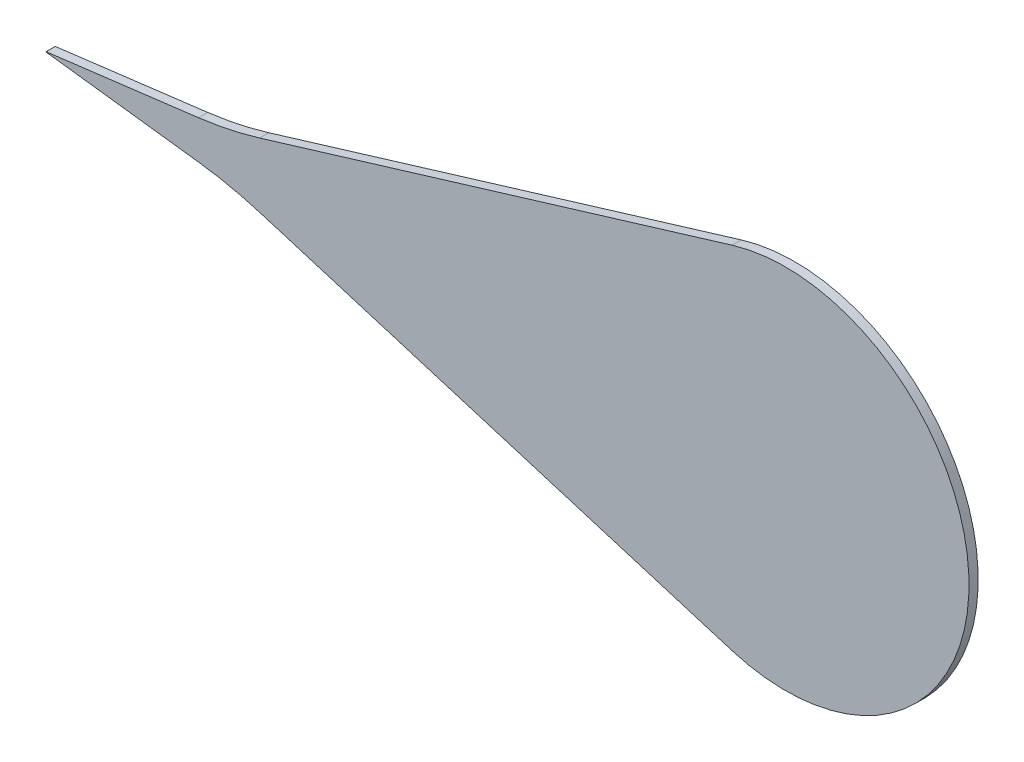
ISO-10303-21;
HEADER;
FILE_DESCRIPTION(('STEP AP214'),'2;1');
FILE_NAME('part.step','',(''),(''),'','','');
FILE_SCHEMA(('AUTOMOTIVE_DESIGN { 1 0 10303 214 1 1 1 1 }'));
ENDSEC;
DATA;
#1=APPLICATION_CONTEXT('core data for automotive mechanical design processes');
#2=APPLICATION_PROTOCOL_DEFINITION('international standard','automotive_design',2000,#1);
#3=PRODUCT_CONTEXT('',#1,'mechanical');
#4=PRODUCT('Part','Part','',(#3));
#5=PRODUCT_RELATED_PRODUCT_CATEGORY('part','',(#4));
#6=PRODUCT_DEFINITION_FORMATION('','',#4);
#7=PRODUCT_DEFINITION_CONTEXT('part definition',#1,'design');
#8=PRODUCT_DEFINITION('design','',#6,#7);
#9=PRODUCT_DEFINITION_SHAPE('','',#8);
#10=(LENGTH_UNIT() NAMED_UNIT(*) SI_UNIT(.MILLI.,.METRE.));
#11=(NAMED_UNIT(*) PLANE_ANGLE_UNIT() SI_UNIT($,.RADIAN.));
#12=(NAMED_UNIT(*) SI_UNIT($,.STERADIAN.) SOLID_ANGLE_UNIT());
#13=UNCERTAINTY_MEASURE_WITH_UNIT(LENGTH_MEASURE(1.E-05),#10,'distance_accuracy_value','');
#14=(GEOMETRIC_REPRESENTATION_CONTEXT(3) GLOBAL_UNCERTAINTY_ASSIGNED_CONTEXT((#13)) GLOBAL_UNIT_ASSIGNED_CONTEXT((#10,
#11,#12)) REPRESENTATION_CONTEXT('',''));
#15=CARTESIAN_POINT('',(0.,0.,0.));
#16=DIRECTION('',(0.,0.,1.));
#17=DIRECTION('',(1.,0.,0.));
#18=AXIS2_PLACEMENT_3D('',#15,#16,#17);
#19=CARTESIAN_POINT('',(0.358,0.,0.25));
#20=DIRECTION('',(0.,0.,-1.));
#21=DIRECTION('',(-1.,0.,0.));
#22=AXIS2_PLACEMENT_3D('',#19,#20,#21);
#23=CYLINDRICAL_SURFACE('',#22,0.0049999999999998);
#24=CARTESIAN_POINT('',(0.358,0.,0.));
#25=DIRECTION('',(0.,0.,1.));
#26=DIRECTION('',(1.,0.,0.));
#27=AXIS2_PLACEMENT_3D('',#24,#25,#26);
#28=CIRCLE('',#27,0.0049999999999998);
#29=CARTESIAN_POINT('',(0.357380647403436,0.00496149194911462,0.));
#30=VERTEX_POINT('',#29);
#31=CARTESIAN_POINT('',(0.357380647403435,-0.00496149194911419,0.));
#32=VERTEX_POINT('',#31);
#33=EDGE_CURVE('E151',#30,#32,#28,.T.);
#34=ORIENTED_EDGE('',*,*,#33,.T.);
#35=DIRECTION('',(0.,0.,-1.));
#36=VECTOR('',#35,1.);
#37=CARTESIAN_POINT('',(0.357380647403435,-0.00496149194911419,0.25));
#38=LINE('',#37,#36);
#39=CARTESIAN_POINT('',(0.357380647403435,-0.00496149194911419,0.25));
#40=VERTEX_POINT('',#39);
#41=EDGE_CURVE('E11',#40,#32,#38,.T.);
#42=ORIENTED_EDGE('',*,*,#41,.F.);
#43=CARTESIAN_POINT('',(0.358,0.,0.25));
#44=DIRECTION('',(0.,0.,1.));
#45=DIRECTION('',(1.,0.,0.));
#46=AXIS2_PLACEMENT_3D('',#43,#44,#45);
#47=CIRCLE('',#46,0.0049999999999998);
#48=CARTESIAN_POINT('',(0.357380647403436,0.00496149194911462,0.25));
#49=VERTEX_POINT('',#48);
#50=EDGE_CURVE('E173',#49,#40,#47,.T.);
#51=ORIENTED_EDGE('',*,*,#50,.F.);
#52=DIRECTION('',(0.,0.,-1.));
#53=VECTOR('',#52,1.);
#54=CARTESIAN_POINT('',(0.357380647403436,0.00496149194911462,0.25));
#55=LINE('',#54,#53);
#56=EDGE_CURVE('E147',#49,#30,#55,.T.);
#57=ORIENTED_EDGE('',*,*,#56,.T.);
#58=EDGE_LOOP('',(#34,#42,#51,#57));
#59=FACE_BOUND('',#58,.T.);
#60=ADVANCED_FACE('F47',(#59),#23,.T.);
#61=CARTESIAN_POINT('',(0.357380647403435,-0.00496149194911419,0.25));
#62=DIRECTION('',(0.123870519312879,0.992298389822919,0.));
#63=DIRECTION('',(-0.992298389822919,0.123870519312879,0.));
#64=AXIS2_PLACEMENT_3D('',#61,#62,#63);
#65=PLANE('',#64);
#66=DIRECTION('',(0.992298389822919,-0.123870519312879,0.));
#67=VECTOR('',#66,1.);
#68=CARTESIAN_POINT('',(0.357380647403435,-0.00496149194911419,0.));
#69=LINE('',#68,#67);
#70=CARTESIAN_POINT('',(4.50941379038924,-0.523267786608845,0.));
#71=VERTEX_POINT('',#70);
#72=EDGE_CURVE('E155',#32,#71,#69,.T.);
#73=ORIENTED_EDGE('',*,*,#72,.T.);
#74=DIRECTION('',(0.,0.,-1.));
#75=VECTOR('',#74,1.);
#76=CARTESIAN_POINT('',(4.50941379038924,-0.523267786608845,0.25));
#77=LINE('',#76,#75);
#78=CARTESIAN_POINT('',(4.50941379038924,-0.523267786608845,0.25));
#79=VERTEX_POINT('',#78);
#80=EDGE_CURVE('E56',#79,#71,#77,.T.);
#81=ORIENTED_EDGE('',*,*,#80,.F.);
#82=DIRECTION('',(0.992298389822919,-0.123870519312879,0.));
#83=VECTOR('',#82,1.);
#84=CARTESIAN_POINT('',(0.357380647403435,-0.00496149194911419,0.25));
#85=LINE('',#84,#83);
#86=EDGE_CURVE('E107',#40,#79,#85,.T.);
#87=ORIENTED_EDGE('',*,*,#86,.F.);
#88=ORIENTED_EDGE('',*,*,#41,.T.);
#89=EDGE_LOOP('',(#73,#81,#87,#88));
#90=FACE_BOUND('',#89,.T.);
#91=ADVANCED_FACE('F220',(#90),#65,.F.);
#92=CARTESIAN_POINT('',(3.27070859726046,-10.446251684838,0.25));
#93=DIRECTION('',(0.,0.,-1.));
#94=DIRECTION('',(-1.,0.,0.));
#95=AXIS2_PLACEMENT_3D('',#92,#93,#94);
#96=CYLINDRICAL_SURFACE('',#95,10.);
#97=CARTESIAN_POINT('',(3.27070859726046,-10.446251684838,0.));
#98=DIRECTION('',(0.,0.,-1.));
#99=DIRECTION('',(-1.,0.,0.));
#100=AXIS2_PLACEMENT_3D('',#97,#98,#99);
#101=CIRCLE('',#100,10.);
#102=CARTESIAN_POINT('',(6.17509248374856,-0.877314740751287,0.));
#103=VERTEX_POINT('',#102);
#104=EDGE_CURVE('E158',#71,#103,#101,.T.);
#105=ORIENTED_EDGE('',*,*,#104,.T.);
#106=DIRECTION('',(0.,0.,-1.));
#107=VECTOR('',#106,1.);
#108=CARTESIAN_POINT('',(6.17509248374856,-0.877314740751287,0.25));
#109=LINE('',#108,#107);
#110=CARTESIAN_POINT('',(6.17509248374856,-0.877314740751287,0.25));
#111=VERTEX_POINT('',#110);
#112=EDGE_CURVE('E183',#111,#103,#109,.T.);
#113=ORIENTED_EDGE('',*,*,#112,.F.);
#114=CARTESIAN_POINT('',(3.27070859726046,-10.446251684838,0.25));
#115=DIRECTION('',(0.,0.,-1.));
#116=DIRECTION('',(-1.,0.,0.));
#117=AXIS2_PLACEMENT_3D('',#114,#115,#116);
#118=CIRCLE('',#117,10.);
#119=EDGE_CURVE('E194',#79,#111,#118,.T.);
#120=ORIENTED_EDGE('',*,*,#119,.F.);
#121=ORIENTED_EDGE('',*,*,#80,.T.);
#122=EDGE_LOOP('',(#105,#113,#120,#121));
#123=FACE_BOUND('',#122,.T.);
#124=ADVANCED_FACE('F192',(#123),#96,.F.);
#125=CARTESIAN_POINT('',(6.17509248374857,-0.877314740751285,0.25));
#126=DIRECTION('',(0.290438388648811,0.956893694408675,0.));
#127=DIRECTION('',(-0.956893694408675,0.290438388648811,0.));
#128=AXIS2_PLACEMENT_3D('',#125,#126,#127);
#129=PLANE('',#128);
#130=DIRECTION('',(0.956893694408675,-0.290438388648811,0.));
#131=VECTOR('',#130,1.);
#132=CARTESIAN_POINT('',(6.17509248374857,-0.877314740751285,0.));
#133=LINE('',#132,#131);
#134=CARTESIAN_POINT('',(19.0478080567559,-4.78446847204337,0.));
#135=VERTEX_POINT('',#134);
#136=EDGE_CURVE('E161',#103,#135,#133,.T.);
#137=ORIENTED_EDGE('',*,*,#136,.T.);
#138=DIRECTION('',(0.,0.,-1.));
#139=VECTOR('',#138,1.);
#140=CARTESIAN_POINT('',(19.0478080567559,-4.78446847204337,0.25));
#141=LINE('',#140,#139);
#142=CARTESIAN_POINT('',(19.0478080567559,-4.78446847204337,0.25));
#143=VERTEX_POINT('',#142);
#144=EDGE_CURVE('E180',#143,#135,#141,.T.);
#145=ORIENTED_EDGE('',*,*,#144,.F.);
#146=DIRECTION('',(0.956893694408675,-0.290438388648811,0.));
#147=VECTOR('',#146,1.);
#148=CARTESIAN_POINT('',(6.17509248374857,-0.877314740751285,0.25));
#149=LINE('',#148,#147);
#150=EDGE_CURVE('E207',#111,#143,#149,.T.);
#151=ORIENTED_EDGE('',*,*,#150,.F.);
#152=ORIENTED_EDGE('',*,*,#112,.T.);
#153=EDGE_LOOP('',(#137,#145,#151,#152));
#154=FACE_BOUND('',#153,.T.);
#155=ADVANCED_FACE('F202',(#154),#129,.F.);
#156=CARTESIAN_POINT('',(20.5,0.,0.25));
#157=DIRECTION('',(0.,0.,-1.));
#158=DIRECTION('',(-1.,0.,0.));
#159=AXIS2_PLACEMENT_3D('',#156,#157,#158);
#160=CYLINDRICAL_SURFACE('',#159,5.);
#161=CARTESIAN_POINT('',(20.5,0.,0.));
#162=DIRECTION('',(0.,0.,1.));
#163=DIRECTION('',(1.,0.,0.));
#164=AXIS2_PLACEMENT_3D('',#161,#162,#163);
#165=CIRCLE('',#164,5.);
#166=CARTESIAN_POINT('',(19.047808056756,4.78446847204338,0.));
#167=VERTEX_POINT('',#166);
#168=EDGE_CURVE('E164',#135,#167,#165,.T.);
#169=ORIENTED_EDGE('',*,*,#168,.T.);
#170=DIRECTION('',(0.,0.,-1.));
#171=VECTOR('',#170,1.);
#172=CARTESIAN_POINT('',(19.047808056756,4.78446847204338,0.25));
#173=LINE('',#172,#171);
#174=CARTESIAN_POINT('',(19.047808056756,4.78446847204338,0.25));
#175=VERTEX_POINT('',#174);
#176=EDGE_CURVE('E137',#175,#167,#173,.T.);
#177=ORIENTED_EDGE('',*,*,#176,.F.);
#178=CARTESIAN_POINT('',(20.5,0.,0.25));
#179=DIRECTION('',(0.,0.,1.));
#180=DIRECTION('',(1.,0.,0.));
#181=AXIS2_PLACEMENT_3D('',#178,#179,#180);
#182=CIRCLE('',#181,5.);
#183=EDGE_CURVE('E126',#143,#175,#182,.T.);
#184=ORIENTED_EDGE('',*,*,#183,.F.);
#185=ORIENTED_EDGE('',*,*,#144,.T.);
#186=EDGE_LOOP('',(#169,#177,#184,#185));
#187=FACE_BOUND('',#186,.T.);
#188=ADVANCED_FACE('F205',(#187),#160,.T.);
#189=CARTESIAN_POINT('',(6.17509248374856,0.877314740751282,0.25));
#190=DIRECTION('',(0.290438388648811,-0.956893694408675,0.));
#191=DIRECTION('',(0.956893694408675,0.290438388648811,0.));
#192=AXIS2_PLACEMENT_3D('',#189,#190,#191);
#193=PLANE('',#192);
#194=DIRECTION('',(-0.956893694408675,-0.290438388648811,0.));
#195=VECTOR('',#194,1.);
#196=CARTESIAN_POINT('',(6.17509248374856,0.877314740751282,0.));
#197=LINE('',#196,#195);
#198=CARTESIAN_POINT('',(6.17509248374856,0.877314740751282,0.));
#199=VERTEX_POINT('',#198);
#200=EDGE_CURVE('E135',#167,#199,#197,.T.);
#201=ORIENTED_EDGE('',*,*,#200,.T.);
#202=DIRECTION('',(0.,0.,-1.));
#203=VECTOR('',#202,1.);
#204=CARTESIAN_POINT('',(6.17509248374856,0.877314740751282,0.25));
#205=LINE('',#204,#203);
#206=CARTESIAN_POINT('',(6.17509248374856,0.877314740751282,0.25));
#207=VERTEX_POINT('',#206);
#208=EDGE_CURVE('E132',#207,#199,#205,.T.);
#209=ORIENTED_EDGE('',*,*,#208,.F.);
#210=DIRECTION('',(-0.956893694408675,-0.290438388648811,0.));
#211=VECTOR('',#210,1.);
#212=CARTESIAN_POINT('',(6.17509248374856,0.877314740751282,0.25));
#213=LINE('',#212,#211);
#214=EDGE_CURVE('E120',#175,#207,#213,.T.);
#215=ORIENTED_EDGE('',*,*,#214,.F.);
#216=ORIENTED_EDGE('',*,*,#176,.T.);
#217=EDGE_LOOP('',(#201,#209,#215,#216));
#218=FACE_BOUND('',#217,.T.);
#219=ADVANCED_FACE('F133',(#218),#193,.F.);
#220=CARTESIAN_POINT('',(3.27070859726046,10.446251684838,0.25));
#221=DIRECTION('',(0.,0.,-1.));
#222=DIRECTION('',(-1.,0.,0.));
#223=AXIS2_PLACEMENT_3D('',#220,#221,#222);
#224=CYLINDRICAL_SURFACE('',#223,10.);
#225=CARTESIAN_POINT('',(3.27070859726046,10.446251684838,0.));
#226=DIRECTION('',(0.,0.,-1.));
#227=DIRECTION('',(1.,0.,0.));
#228=AXIS2_PLACEMENT_3D('',#225,#226,#227);
#229=CIRCLE('',#228,10.);
#230=CARTESIAN_POINT('',(4.50941379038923,0.523267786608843,0.));
#231=VERTEX_POINT('',#230);
#232=EDGE_CURVE('E93',#199,#231,#229,.T.);
#233=ORIENTED_EDGE('',*,*,#232,.T.);
#234=DIRECTION('',(0.,0.,-1.));
#235=VECTOR('',#234,1.);
#236=CARTESIAN_POINT('',(4.50941379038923,0.523267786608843,0.25));
#237=LINE('',#236,#235);
#238=CARTESIAN_POINT('',(4.50941379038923,0.523267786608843,0.25));
#239=VERTEX_POINT('',#238);
#240=EDGE_CURVE('E138',#239,#231,#237,.T.);
#241=ORIENTED_EDGE('',*,*,#240,.F.);
#242=CARTESIAN_POINT('',(3.27070859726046,10.446251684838,0.25));
#243=DIRECTION('',(0.,0.,-1.));
#244=DIRECTION('',(1.,0.,0.));
#245=AXIS2_PLACEMENT_3D('',#242,#243,#244);
#246=CIRCLE('',#245,10.);
#247=EDGE_CURVE('E124',#207,#239,#246,.T.);
#248=ORIENTED_EDGE('',*,*,#247,.F.);
#249=ORIENTED_EDGE('',*,*,#208,.T.);
#250=EDGE_LOOP('',(#233,#241,#248,#249));
#251=FACE_BOUND('',#250,.T.);
#252=ADVANCED_FACE('F140',(#251),#224,.F.);
#253=CARTESIAN_POINT('',(0.357380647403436,0.00496149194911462,0.25));
#254=DIRECTION('',(0.123870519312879,-0.992298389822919,0.));
#255=DIRECTION('',(0.992298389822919,0.123870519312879,0.));
#256=AXIS2_PLACEMENT_3D('',#253,#254,#255);
#257=PLANE('',#256);
#258=DIRECTION('',(-0.992298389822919,-0.123870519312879,0.));
#259=VECTOR('',#258,1.);
#260=CARTESIAN_POINT('',(0.357380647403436,0.00496149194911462,0.));
#261=LINE('',#260,#259);
#262=EDGE_CURVE('E99',#231,#30,#261,.T.);
#263=ORIENTED_EDGE('',*,*,#262,.T.);
#264=ORIENTED_EDGE('',*,*,#56,.F.);
#265=DIRECTION('',(-0.992298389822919,-0.123870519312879,0.));
#266=VECTOR('',#265,1.);
#267=CARTESIAN_POINT('',(0.357380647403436,0.00496149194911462,0.25));
#268=LINE('',#267,#266);
#269=EDGE_CURVE('E64',#239,#49,#268,.T.);
#270=ORIENTED_EDGE('',*,*,#269,.F.);
#271=ORIENTED_EDGE('',*,*,#240,.T.);
#272=EDGE_LOOP('',(#263,#264,#270,#271));
#273=FACE_BOUND('',#272,.T.);
#274=ADVANCED_FACE('F236',(#273),#257,.F.);
#275=CARTESIAN_POINT('',(0.358,0.,0.25));
#276=DIRECTION('',(0.,0.,1.));
#277=DIRECTION('',(1.,0.,0.));
#278=AXIS2_PLACEMENT_3D('',#275,#276,#277);
#279=PLANE('',#278);
#280=ORIENTED_EDGE('',*,*,#50,.T.);
#281=ORIENTED_EDGE('',*,*,#86,.T.);
#282=ORIENTED_EDGE('',*,*,#119,.T.);
#283=ORIENTED_EDGE('',*,*,#150,.T.);
#284=ORIENTED_EDGE('',*,*,#183,.T.);
#285=ORIENTED_EDGE('',*,*,#214,.T.);
#286=ORIENTED_EDGE('',*,*,#247,.T.);
#287=ORIENTED_EDGE('',*,*,#269,.T.);
#288=EDGE_LOOP('',(#280,#281,#282,#283,#284,#285,#286,#287));
#289=FACE_BOUND('',#288,.T.);
#290=ADVANCED_FACE('F122',(#289),#279,.T.);
#291=CARTESIAN_POINT('',(0.358,0.,0.));
#292=DIRECTION('',(0.,0.,1.));
#293=DIRECTION('',(1.,0.,0.));
#294=AXIS2_PLACEMENT_3D('',#291,#292,#293);
#295=PLANE('',#294);
#296=ORIENTED_EDGE('',*,*,#33,.F.);
#297=ORIENTED_EDGE('',*,*,#262,.F.);
#298=ORIENTED_EDGE('',*,*,#232,.F.);
#299=ORIENTED_EDGE('',*,*,#200,.F.);
#300=ORIENTED_EDGE('',*,*,#168,.F.);
#301=ORIENTED_EDGE('',*,*,#136,.F.);
#302=ORIENTED_EDGE('',*,*,#104,.F.);
#303=ORIENTED_EDGE('',*,*,#72,.F.);
#304=EDGE_LOOP('',(#296,#297,#298,#299,#300,#301,#302,#303));
#305=FACE_BOUND('',#304,.T.);
#306=ADVANCED_FACE('F198',(#305),#295,.F.);
#307=CLOSED_SHELL('',(#60,#91,#124,#155,#188,#219,#252,#274,#290,#306));
#308=MANIFOLD_SOLID_BREP('B2',#307);
#309=ADVANCED_BREP_SHAPE_REPRESENTATION('',(#18,#308),#14);
#310=SHAPE_DEFINITION_REPRESENTATION(#9,#309);
ENDSEC;
END-ISO-10303-21;
